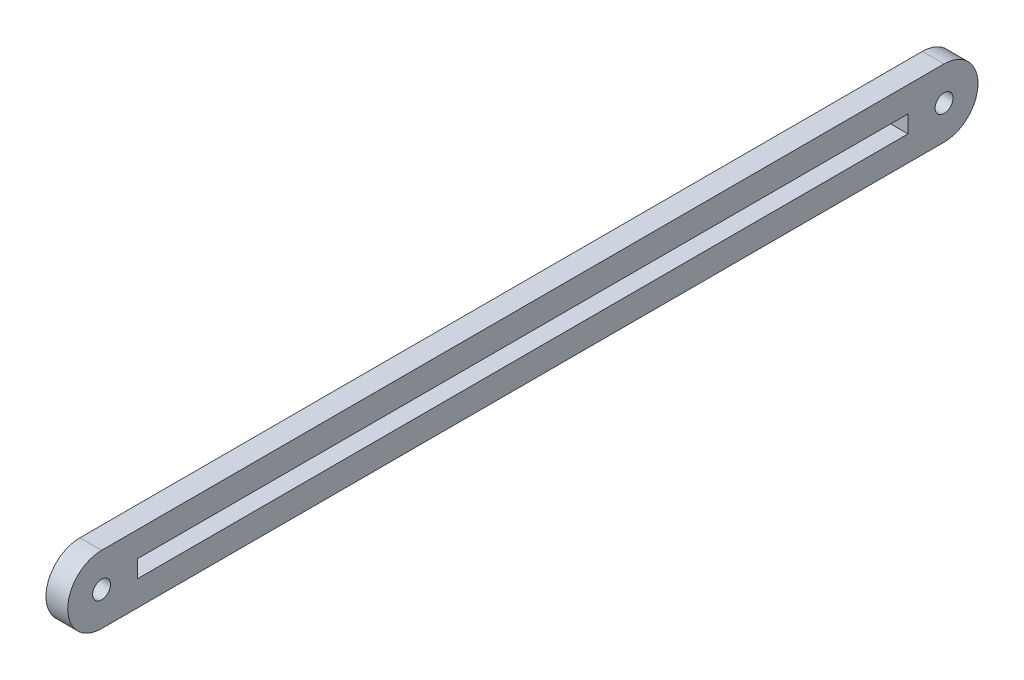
ISO-10303-21;
HEADER;
FILE_DESCRIPTION(('STEP AP214'),'2;1');
FILE_NAME('part.step','',(''),(''),'','','');
FILE_SCHEMA(('AUTOMOTIVE_DESIGN { 1 0 10303 214 1 1 1 1 }'));
ENDSEC;
DATA;
#1=APPLICATION_CONTEXT('core data for automotive mechanical design processes');
#2=APPLICATION_PROTOCOL_DEFINITION('international standard','automotive_design',2000,#1);
#3=PRODUCT_CONTEXT('',#1,'mechanical');
#4=PRODUCT('Part','Part','',(#3));
#5=PRODUCT_RELATED_PRODUCT_CATEGORY('part','',(#4));
#6=PRODUCT_DEFINITION_FORMATION('','',#4);
#7=PRODUCT_DEFINITION_CONTEXT('part definition',#1,'design');
#8=PRODUCT_DEFINITION('design','',#6,#7);
#9=PRODUCT_DEFINITION_SHAPE('','',#8);
#10=(LENGTH_UNIT() NAMED_UNIT(*) SI_UNIT(.MILLI.,.METRE.));
#11=(NAMED_UNIT(*) PLANE_ANGLE_UNIT() SI_UNIT($,.RADIAN.));
#12=(NAMED_UNIT(*) SI_UNIT($,.STERADIAN.) SOLID_ANGLE_UNIT());
#13=UNCERTAINTY_MEASURE_WITH_UNIT(LENGTH_MEASURE(1.E-05),#10,'distance_accuracy_value','');
#14=(GEOMETRIC_REPRESENTATION_CONTEXT(3) GLOBAL_UNCERTAINTY_ASSIGNED_CONTEXT((#13)) GLOBAL_UNIT_ASSIGNED_CONTEXT((#10,
#11,#12)) REPRESENTATION_CONTEXT('',''));
#15=CARTESIAN_POINT('',(0.,0.,0.));
#16=DIRECTION('',(0.,0.,1.));
#17=DIRECTION('',(1.,0.,0.));
#18=AXIS2_PLACEMENT_3D('',#15,#16,#17);
#19=CARTESIAN_POINT('',(4.,0.,77.65));
#20=DIRECTION('',(1.,0.,0.));
#21=DIRECTION('',(0.,0.,-1.));
#22=AXIS2_PLACEMENT_3D('',#19,#20,#21);
#23=PLANE('',#22);
#24=DIRECTION('',(0.,0.,1.));
#25=VECTOR('',#24,1.);
#26=CARTESIAN_POINT('',(4.,1.6,71.));
#27=LINE('',#26,#25);
#28=CARTESIAN_POINT('',(4.,1.6,-71.));
#29=VERTEX_POINT('',#28);
#30=CARTESIAN_POINT('',(4.,1.6,71.));
#31=VERTEX_POINT('',#30);
#32=EDGE_CURVE('E120',#29,#31,#27,.T.);
#33=ORIENTED_EDGE('',*,*,#32,.F.);
#34=DIRECTION('',(0.,1.,0.));
#35=VECTOR('',#34,1.);
#36=CARTESIAN_POINT('',(4.,-1.6,-71.));
#37=LINE('',#36,#35);
#38=CARTESIAN_POINT('',(4.,-1.6,-71.));
#39=VERTEX_POINT('',#38);
#40=EDGE_CURVE('E111',#39,#29,#37,.T.);
#41=ORIENTED_EDGE('',*,*,#40,.F.);
#42=DIRECTION('',(0.,0.,-1.));
#43=VECTOR('',#42,1.);
#44=CARTESIAN_POINT('',(4.,-1.6,71.));
#45=LINE('',#44,#43);
#46=CARTESIAN_POINT('',(4.,-1.6,71.));
#47=VERTEX_POINT('',#46);
#48=EDGE_CURVE('E138',#47,#39,#45,.T.);
#49=ORIENTED_EDGE('',*,*,#48,.F.);
#50=DIRECTION('',(0.,-1.,0.));
#51=VECTOR('',#50,1.);
#52=CARTESIAN_POINT('',(4.,-1.6,71.));
#53=LINE('',#52,#51);
#54=EDGE_CURVE('E134',#31,#47,#53,.T.);
#55=ORIENTED_EDGE('',*,*,#54,.F.);
#56=EDGE_LOOP('',(#33,#41,#49,#55));
#57=FACE_BOUND('',#56,.T.);
#58=CARTESIAN_POINT('',(4.,0.,77.65));
#59=DIRECTION('',(1.,0.,0.));
#60=DIRECTION('',(0.,0.,-1.));
#61=AXIS2_PLACEMENT_3D('',#58,#59,#60);
#62=CIRCLE('',#61,1.65);
#63=CARTESIAN_POINT('',(4.,0.,76.));
#64=VERTEX_POINT('',#63);
#65=EDGE_CURVE('E162',#64,#64,#62,.T.);
#66=ORIENTED_EDGE('',*,*,#65,.F.);
#67=EDGE_LOOP('',(#66));
#68=FACE_BOUND('',#67,.T.);
#69=CARTESIAN_POINT('',(4.,0.,77.65));
#70=DIRECTION('',(1.,0.,0.));
#71=DIRECTION('',(0.,0.,-1.));
#72=AXIS2_PLACEMENT_3D('',#69,#70,#71);
#73=CIRCLE('',#72,6.25);
#74=CARTESIAN_POINT('',(4.,6.25,77.65));
#75=VERTEX_POINT('',#74);
#76=CARTESIAN_POINT('',(4.,-6.25,77.65));
#77=VERTEX_POINT('',#76);
#78=EDGE_CURVE('E170',#75,#77,#73,.T.);
#79=ORIENTED_EDGE('',*,*,#78,.T.);
#80=DIRECTION('',(0.,0.,-1.));
#81=VECTOR('',#80,1.);
#82=CARTESIAN_POINT('',(4.,-6.25,77.65));
#83=LINE('',#82,#81);
#84=CARTESIAN_POINT('',(4.,-6.25,-77.65));
#85=VERTEX_POINT('',#84);
#86=EDGE_CURVE('E174',#77,#85,#83,.T.);
#87=ORIENTED_EDGE('',*,*,#86,.T.);
#88=CARTESIAN_POINT('',(4.,0.,-77.65));
#89=DIRECTION('',(1.,0.,0.));
#90=DIRECTION('',(0.,0.,1.));
#91=AXIS2_PLACEMENT_3D('',#88,#89,#90);
#92=CIRCLE('',#91,6.25);
#93=CARTESIAN_POINT('',(4.,6.25,-77.65));
#94=VERTEX_POINT('',#93);
#95=EDGE_CURVE('E178',#85,#94,#92,.T.);
#96=ORIENTED_EDGE('',*,*,#95,.T.);
#97=DIRECTION('',(0.,0.,1.));
#98=VECTOR('',#97,1.);
#99=CARTESIAN_POINT('',(4.,6.25,77.65));
#100=LINE('',#99,#98);
#101=EDGE_CURVE('E181',#94,#75,#100,.T.);
#102=ORIENTED_EDGE('',*,*,#101,.T.);
#103=EDGE_LOOP('',(#79,#87,#96,#102));
#104=FACE_BOUND('',#103,.T.);
#105=CARTESIAN_POINT('',(4.,0.,-77.65));
#106=DIRECTION('',(1.,0.,0.));
#107=DIRECTION('',(0.,0.,1.));
#108=AXIS2_PLACEMENT_3D('',#105,#106,#107);
#109=CIRCLE('',#108,1.65);
#110=CARTESIAN_POINT('',(4.,0.,-76.));
#111=VERTEX_POINT('',#110);
#112=EDGE_CURVE('E146',#111,#111,#109,.T.);
#113=ORIENTED_EDGE('',*,*,#112,.F.);
#114=EDGE_LOOP('',(#113));
#115=FACE_BOUND('',#114,.T.);
#116=ADVANCED_FACE('F45',(#57,#68,#104,#115),#23,.T.);
#117=CARTESIAN_POINT('',(0.,0.,77.65));
#118=DIRECTION('',(1.,0.,0.));
#119=DIRECTION('',(0.,0.,-1.));
#120=AXIS2_PLACEMENT_3D('',#117,#118,#119);
#121=PLANE('',#120);
#122=CARTESIAN_POINT('',(0.,0.,77.65));
#123=DIRECTION('',(1.,0.,0.));
#124=DIRECTION('',(0.,0.,-1.));
#125=AXIS2_PLACEMENT_3D('',#122,#123,#124);
#126=CIRCLE('',#125,1.65);
#127=CARTESIAN_POINT('',(0.,0.,76.));
#128=VERTEX_POINT('',#127);
#129=EDGE_CURVE('E129',#128,#128,#126,.T.);
#130=ORIENTED_EDGE('',*,*,#129,.T.);
#131=EDGE_LOOP('',(#130));
#132=FACE_BOUND('',#131,.T.);
#133=CARTESIAN_POINT('',(0.,0.,77.65));
#134=DIRECTION('',(1.,0.,0.));
#135=DIRECTION('',(0.,0.,-1.));
#136=AXIS2_PLACEMENT_3D('',#133,#134,#135);
#137=CIRCLE('',#136,6.25);
#138=CARTESIAN_POINT('',(0.,6.25,77.65));
#139=VERTEX_POINT('',#138);
#140=CARTESIAN_POINT('',(0.,-6.25,77.65));
#141=VERTEX_POINT('',#140);
#142=EDGE_CURVE('E166',#139,#141,#137,.T.);
#143=ORIENTED_EDGE('',*,*,#142,.F.);
#144=DIRECTION('',(0.,0.,1.));
#145=VECTOR('',#144,1.);
#146=CARTESIAN_POINT('',(0.,6.25,77.65));
#147=LINE('',#146,#145);
#148=CARTESIAN_POINT('',(0.,6.25,-77.65));
#149=VERTEX_POINT('',#148);
#150=EDGE_CURVE('E175',#149,#139,#147,.T.);
#151=ORIENTED_EDGE('',*,*,#150,.F.);
#152=CARTESIAN_POINT('',(0.,0.,-77.65));
#153=DIRECTION('',(1.,0.,0.));
#154=DIRECTION('',(0.,0.,1.));
#155=AXIS2_PLACEMENT_3D('',#152,#153,#154);
#156=CIRCLE('',#155,6.25);
#157=CARTESIAN_POINT('',(0.,-6.25,-77.65));
#158=VERTEX_POINT('',#157);
#159=EDGE_CURVE('E191',#158,#149,#156,.T.);
#160=ORIENTED_EDGE('',*,*,#159,.F.);
#161=DIRECTION('',(0.,0.,-1.));
#162=VECTOR('',#161,1.);
#163=CARTESIAN_POINT('',(0.,-6.25,77.65));
#164=LINE('',#163,#162);
#165=EDGE_CURVE('E188',#141,#158,#164,.T.);
#166=ORIENTED_EDGE('',*,*,#165,.F.);
#167=EDGE_LOOP('',(#143,#151,#160,#166));
#168=FACE_BOUND('',#167,.T.);
#169=DIRECTION('',(0.,1.,0.));
#170=VECTOR('',#169,1.);
#171=CARTESIAN_POINT('',(0.,-1.6,-71.));
#172=LINE('',#171,#170);
#173=CARTESIAN_POINT('',(0.,-1.6,-71.));
#174=VERTEX_POINT('',#173);
#175=CARTESIAN_POINT('',(0.,1.6,-71.));
#176=VERTEX_POINT('',#175);
#177=EDGE_CURVE('E69',#174,#176,#172,.T.);
#178=ORIENTED_EDGE('',*,*,#177,.T.);
#179=DIRECTION('',(0.,0.,1.));
#180=VECTOR('',#179,1.);
#181=CARTESIAN_POINT('',(0.,1.6,71.));
#182=LINE('',#181,#180);
#183=CARTESIAN_POINT('',(0.,1.6,71.));
#184=VERTEX_POINT('',#183);
#185=EDGE_CURVE('E127',#176,#184,#182,.T.);
#186=ORIENTED_EDGE('',*,*,#185,.T.);
#187=DIRECTION('',(0.,-1.,0.));
#188=VECTOR('',#187,1.);
#189=CARTESIAN_POINT('',(0.,-1.6,71.));
#190=LINE('',#189,#188);
#191=CARTESIAN_POINT('',(0.,-1.6,71.));
#192=VERTEX_POINT('',#191);
#193=EDGE_CURVE('E149',#184,#192,#190,.T.);
#194=ORIENTED_EDGE('',*,*,#193,.T.);
#195=DIRECTION('',(0.,0.,-1.));
#196=VECTOR('',#195,1.);
#197=CARTESIAN_POINT('',(0.,-1.6,71.));
#198=LINE('',#197,#196);
#199=EDGE_CURVE('E121',#192,#174,#198,.T.);
#200=ORIENTED_EDGE('',*,*,#199,.T.);
#201=EDGE_LOOP('',(#178,#186,#194,#200));
#202=FACE_BOUND('',#201,.T.);
#203=CARTESIAN_POINT('',(0.,0.,-77.65));
#204=DIRECTION('',(1.,0.,0.));
#205=DIRECTION('',(0.,0.,1.));
#206=AXIS2_PLACEMENT_3D('',#203,#204,#205);
#207=CIRCLE('',#206,1.65);
#208=CARTESIAN_POINT('',(0.,0.,-76.));
#209=VERTEX_POINT('',#208);
#210=EDGE_CURVE('E276',#209,#209,#207,.T.);
#211=ORIENTED_EDGE('',*,*,#210,.T.);
#212=EDGE_LOOP('',(#211));
#213=FACE_BOUND('',#212,.T.);
#214=ADVANCED_FACE('F214',(#132,#168,#202,#213),#121,.F.);
#215=CARTESIAN_POINT('',(4.,0.,77.65));
#216=DIRECTION('',(-1.,0.,0.));
#217=DIRECTION('',(0.,0.,1.));
#218=AXIS2_PLACEMENT_3D('',#215,#216,#217);
#219=CYLINDRICAL_SURFACE('',#218,6.25);
#220=ORIENTED_EDGE('',*,*,#142,.T.);
#221=DIRECTION('',(-1.,0.,0.));
#222=VECTOR('',#221,1.);
#223=CARTESIAN_POINT('',(4.,-6.25,77.65));
#224=LINE('',#223,#222);
#225=EDGE_CURVE('E11',#77,#141,#224,.T.);
#226=ORIENTED_EDGE('',*,*,#225,.F.);
#227=ORIENTED_EDGE('',*,*,#78,.F.);
#228=DIRECTION('',(-1.,0.,0.));
#229=VECTOR('',#228,1.);
#230=CARTESIAN_POINT('',(4.,6.25,77.65));
#231=LINE('',#230,#229);
#232=EDGE_CURVE('E184',#75,#139,#231,.T.);
#233=ORIENTED_EDGE('',*,*,#232,.T.);
#234=EDGE_LOOP('',(#220,#226,#227,#233));
#235=FACE_BOUND('',#234,.T.);
#236=ADVANCED_FACE('F47',(#235),#219,.T.);
#237=CARTESIAN_POINT('',(4.,-6.25,77.65));
#238=DIRECTION('',(0.,1.,0.));
#239=DIRECTION('',(0.,0.,1.));
#240=AXIS2_PLACEMENT_3D('',#237,#238,#239);
#241=PLANE('',#240);
#242=ORIENTED_EDGE('',*,*,#165,.T.);
#243=DIRECTION('',(-1.,0.,0.));
#244=VECTOR('',#243,1.);
#245=CARTESIAN_POINT('',(4.,-6.25,-77.65));
#246=LINE('',#245,#244);
#247=EDGE_CURVE('E54',#85,#158,#246,.T.);
#248=ORIENTED_EDGE('',*,*,#247,.F.);
#249=ORIENTED_EDGE('',*,*,#86,.F.);
#250=ORIENTED_EDGE('',*,*,#225,.T.);
#251=EDGE_LOOP('',(#242,#248,#249,#250));
#252=FACE_BOUND('',#251,.T.);
#253=ADVANCED_FACE('F225',(#252),#241,.F.);
#254=CARTESIAN_POINT('',(4.,0.,-77.65));
#255=DIRECTION('',(-1.,0.,0.));
#256=DIRECTION('',(0.,0.,1.));
#257=AXIS2_PLACEMENT_3D('',#254,#255,#256);
#258=CYLINDRICAL_SURFACE('',#257,6.25);
#259=ORIENTED_EDGE('',*,*,#159,.T.);
#260=DIRECTION('',(-1.,0.,0.));
#261=VECTOR('',#260,1.);
#262=CARTESIAN_POINT('',(4.,6.25,-77.65));
#263=LINE('',#262,#261);
#264=EDGE_CURVE('E199',#94,#149,#263,.T.);
#265=ORIENTED_EDGE('',*,*,#264,.F.);
#266=ORIENTED_EDGE('',*,*,#95,.F.);
#267=ORIENTED_EDGE('',*,*,#247,.T.);
#268=EDGE_LOOP('',(#259,#265,#266,#267));
#269=FACE_BOUND('',#268,.T.);
#270=ADVANCED_FACE('F208',(#269),#258,.T.);
#271=CARTESIAN_POINT('',(4.,6.25,77.65));
#272=DIRECTION('',(0.,-1.,0.));
#273=DIRECTION('',(0.,0.,-1.));
#274=AXIS2_PLACEMENT_3D('',#271,#272,#273);
#275=PLANE('',#274);
#276=ORIENTED_EDGE('',*,*,#150,.T.);
#277=ORIENTED_EDGE('',*,*,#232,.F.);
#278=ORIENTED_EDGE('',*,*,#101,.F.);
#279=ORIENTED_EDGE('',*,*,#264,.T.);
#280=EDGE_LOOP('',(#276,#277,#278,#279));
#281=FACE_BOUND('',#280,.T.);
#282=ADVANCED_FACE('F218',(#281),#275,.F.);
#283=CARTESIAN_POINT('',(4.,0.,77.65));
#284=DIRECTION('',(-1.,0.,0.));
#285=DIRECTION('',(0.,0.,1.));
#286=AXIS2_PLACEMENT_3D('',#283,#284,#285);
#287=CYLINDRICAL_SURFACE('',#286,1.65);
#288=ORIENTED_EDGE('',*,*,#65,.T.);
#289=EDGE_LOOP('',(#288));
#290=FACE_BOUND('',#289,.T.);
#291=ORIENTED_EDGE('',*,*,#129,.F.);
#292=EDGE_LOOP('',(#291));
#293=FACE_BOUND('',#292,.T.);
#294=ADVANCED_FACE('F240',(#290,#293),#287,.F.);
#295=CARTESIAN_POINT('',(4.,-1.6,-71.));
#296=DIRECTION('',(0.,0.,1.));
#297=DIRECTION('',(1.,0.,0.));
#298=AXIS2_PLACEMENT_3D('',#295,#296,#297);
#299=PLANE('',#298);
#300=ORIENTED_EDGE('',*,*,#177,.F.);
#301=DIRECTION('',(-1.,0.,0.));
#302=VECTOR('',#301,1.);
#303=CARTESIAN_POINT('',(4.,-1.6,-71.));
#304=LINE('',#303,#302);
#305=EDGE_CURVE('E115',#39,#174,#304,.T.);
#306=ORIENTED_EDGE('',*,*,#305,.F.);
#307=ORIENTED_EDGE('',*,*,#40,.T.);
#308=DIRECTION('',(-1.,0.,0.));
#309=VECTOR('',#308,1.);
#310=CARTESIAN_POINT('',(4.,1.6,-71.));
#311=LINE('',#310,#309);
#312=EDGE_CURVE('E114',#29,#176,#311,.T.);
#313=ORIENTED_EDGE('',*,*,#312,.T.);
#314=EDGE_LOOP('',(#300,#306,#307,#313));
#315=FACE_BOUND('',#314,.T.);
#316=ADVANCED_FACE('F113',(#315),#299,.T.);
#317=CARTESIAN_POINT('',(4.,1.6,71.));
#318=DIRECTION('',(0.,-1.,0.));
#319=DIRECTION('',(0.,0.,-1.));
#320=AXIS2_PLACEMENT_3D('',#317,#318,#319);
#321=PLANE('',#320);
#322=ORIENTED_EDGE('',*,*,#185,.F.);
#323=ORIENTED_EDGE('',*,*,#312,.F.);
#324=ORIENTED_EDGE('',*,*,#32,.T.);
#325=DIRECTION('',(-1.,0.,0.));
#326=VECTOR('',#325,1.);
#327=CARTESIAN_POINT('',(4.,1.6,71.));
#328=LINE('',#327,#326);
#329=EDGE_CURVE('E130',#31,#184,#328,.T.);
#330=ORIENTED_EDGE('',*,*,#329,.T.);
#331=EDGE_LOOP('',(#322,#323,#324,#330));
#332=FACE_BOUND('',#331,.T.);
#333=ADVANCED_FACE('F124',(#332),#321,.T.);
#334=CARTESIAN_POINT('',(4.,-1.6,71.));
#335=DIRECTION('',(0.,0.,-1.));
#336=DIRECTION('',(-1.,0.,0.));
#337=AXIS2_PLACEMENT_3D('',#334,#335,#336);
#338=PLANE('',#337);
#339=ORIENTED_EDGE('',*,*,#193,.F.);
#340=ORIENTED_EDGE('',*,*,#329,.F.);
#341=ORIENTED_EDGE('',*,*,#54,.T.);
#342=DIRECTION('',(-1.,0.,0.));
#343=VECTOR('',#342,1.);
#344=CARTESIAN_POINT('',(4.,-1.6,71.));
#345=LINE('',#344,#343);
#346=EDGE_CURVE('E61',#47,#192,#345,.T.);
#347=ORIENTED_EDGE('',*,*,#346,.T.);
#348=EDGE_LOOP('',(#339,#340,#341,#347));
#349=FACE_BOUND('',#348,.T.);
#350=ADVANCED_FACE('F257',(#349),#338,.T.);
#351=CARTESIAN_POINT('',(4.,-1.6,71.));
#352=DIRECTION('',(0.,1.,0.));
#353=DIRECTION('',(0.,0.,1.));
#354=AXIS2_PLACEMENT_3D('',#351,#352,#353);
#355=PLANE('',#354);
#356=ORIENTED_EDGE('',*,*,#199,.F.);
#357=ORIENTED_EDGE('',*,*,#346,.F.);
#358=ORIENTED_EDGE('',*,*,#48,.T.);
#359=ORIENTED_EDGE('',*,*,#305,.T.);
#360=EDGE_LOOP('',(#356,#357,#358,#359));
#361=FACE_BOUND('',#360,.T.);
#362=ADVANCED_FACE('F262',(#361),#355,.T.);
#363=CARTESIAN_POINT('',(4.,0.,-77.65));
#364=DIRECTION('',(-1.,0.,0.));
#365=DIRECTION('',(0.,0.,1.));
#366=AXIS2_PLACEMENT_3D('',#363,#364,#365);
#367=CYLINDRICAL_SURFACE('',#366,1.65);
#368=ORIENTED_EDGE('',*,*,#112,.T.);
#369=EDGE_LOOP('',(#368));
#370=FACE_BOUND('',#369,.T.);
#371=ORIENTED_EDGE('',*,*,#210,.F.);
#372=EDGE_LOOP('',(#371));
#373=FACE_BOUND('',#372,.T.);
#374=ADVANCED_FACE('F266',(#370,#373),#367,.F.);
#375=CLOSED_SHELL('',(#116,#214,#236,#253,#270,#282,#294,#316,#333,#350,#362,#374));
#376=MANIFOLD_SOLID_BREP('B2',#375);
#377=ADVANCED_BREP_SHAPE_REPRESENTATION('',(#18,#376),#14);
#378=SHAPE_DEFINITION_REPRESENTATION(#9,#377);
ENDSEC;
END-ISO-10303-21;
